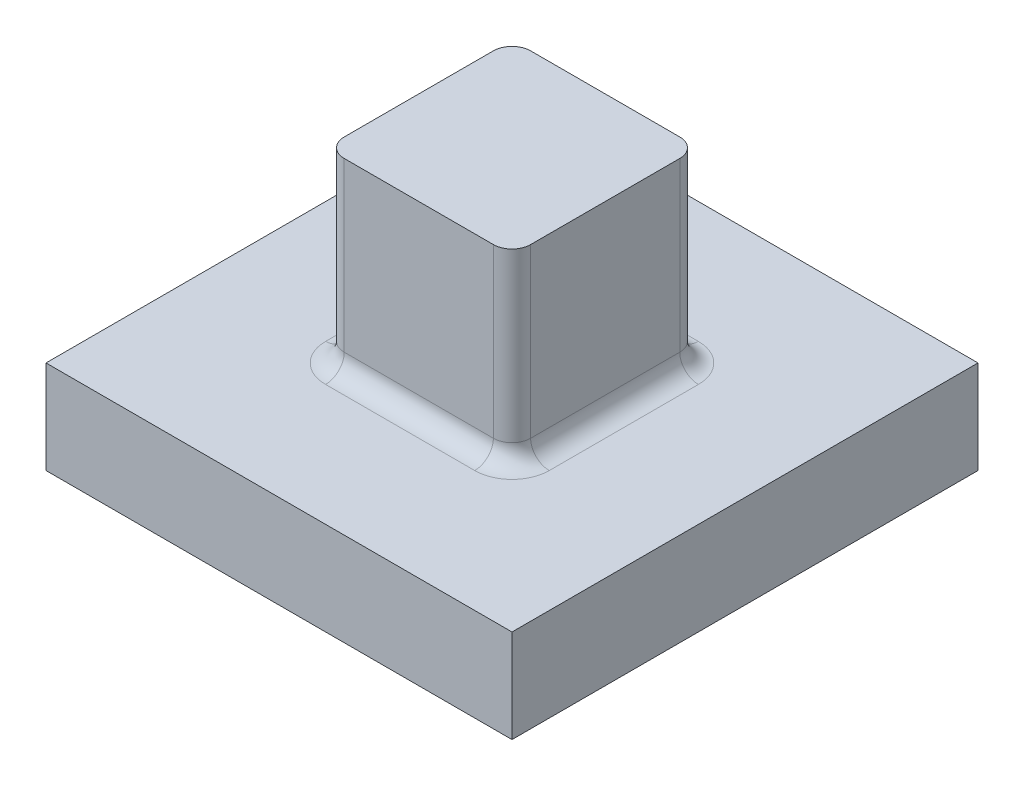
from build123d import *

# Parameters (mm, degrees)
SKETCH1_W           = 50
SKETCH1_H           = 50
EXTRUDE1_DEPTH      = 30
SKETCH2_OUTSIDE_W   = 67.362
SKETCH2_OUTSIDE_H   = 67.362
SKETCH2_OUTSIDE_W_2 = 20
SKETCH2_OUTSIDE_H_2 = 20
CUT_EXTRUDE1_DEPTH  = 20
FILLET1_R           = 2


with BuildPart() as part:
    # Sketch1 → Extrude1 (new body)
    with BuildSketch(Plane(origin=(0, 0, 0), x_dir=(1, 0, 0), z_dir=(0, 1, 0))):
        with Locations((-25, 25)):
            Rectangle(SKETCH1_W, SKETCH1_H)
    extrude(amount=EXTRUDE1_DEPTH)

    # Sketch2 outside → Cut-Extrude1 (cut)
    with BuildSketch(Plane(origin=(0, 30, 0), x_dir=(-1, 0, 0), z_dir=(0, 1, 0))):
        with Locations((25, -25)):
            Rectangle(SKETCH2_OUTSIDE_W, SKETCH2_OUTSIDE_H)
        with Locations((25, -25)):
            Rectangle(SKETCH2_OUTSIDE_W_2, SKETCH2_OUTSIDE_H_2, mode=Mode.SUBTRACT)
    extrude(amount=-CUT_EXTRUDE1_DEPTH, mode=Mode.SUBTRACT)

    # Fillet1
    fillet1_edges = [part.edges().sort_by_distance(p)[0] for p in [
        (-35, 10, -25),
        (-25, 10, -15),
        (-15, 10, -25),
        (-25, 10, -35),
        (-35, 20, -15),
        (-35, 20, -35),
        (-15, 20, -35),
        (-15, 20, -15),
    ]]
    fillet(fillet1_edges, radius=FILLET1_R)


solid = part.part
